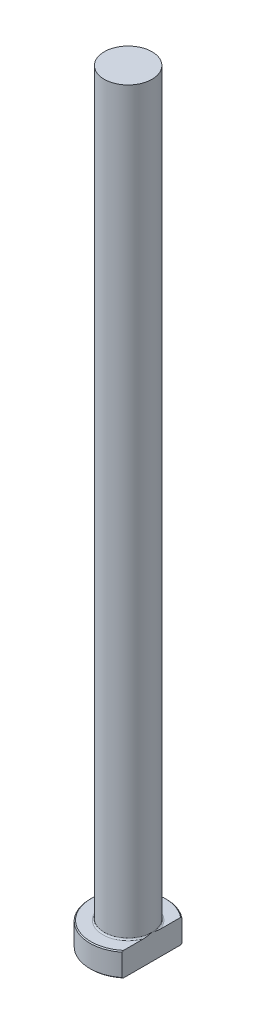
ISO-10303-21;
HEADER;
FILE_DESCRIPTION(('STEP AP214'),'2;1');
FILE_NAME('part.step','',(''),(''),'','','');
FILE_SCHEMA(('AUTOMOTIVE_DESIGN { 1 0 10303 214 1 1 1 1 }'));
ENDSEC;
DATA;
#1=APPLICATION_CONTEXT('core data for automotive mechanical design processes');
#2=APPLICATION_PROTOCOL_DEFINITION('international standard','automotive_design',2000,#1);
#3=PRODUCT_CONTEXT('',#1,'mechanical');
#4=PRODUCT('Part','Part','',(#3));
#5=PRODUCT_RELATED_PRODUCT_CATEGORY('part','',(#4));
#6=PRODUCT_DEFINITION_FORMATION('','',#4);
#7=PRODUCT_DEFINITION_CONTEXT('part definition',#1,'design');
#8=PRODUCT_DEFINITION('design','',#6,#7);
#9=PRODUCT_DEFINITION_SHAPE('','',#8);
#10=(LENGTH_UNIT() NAMED_UNIT(*) SI_UNIT(.MILLI.,.METRE.));
#11=(NAMED_UNIT(*) PLANE_ANGLE_UNIT() SI_UNIT($,.RADIAN.));
#12=(NAMED_UNIT(*) SI_UNIT($,.STERADIAN.) SOLID_ANGLE_UNIT());
#13=UNCERTAINTY_MEASURE_WITH_UNIT(LENGTH_MEASURE(1.E-05),#10,'distance_accuracy_value','');
#14=(GEOMETRIC_REPRESENTATION_CONTEXT(3) GLOBAL_UNCERTAINTY_ASSIGNED_CONTEXT((#13)) GLOBAL_UNIT_ASSIGNED_CONTEXT((#10,
#11,#12)) REPRESENTATION_CONTEXT('',''));
#15=CARTESIAN_POINT('',(0.,0.,0.));
#16=DIRECTION('',(0.,0.,1.));
#17=DIRECTION('',(1.,0.,0.));
#18=AXIS2_PLACEMENT_3D('',#15,#16,#17);
#19=CARTESIAN_POINT('',(0.,0.,0.));
#20=DIRECTION('',(0.,-1.,0.));
#21=DIRECTION('',(0.,0.,-1.));
#22=AXIS2_PLACEMENT_3D('',#19,#20,#21);
#23=PLANE('',#22);
#24=CARTESIAN_POINT('',(0.,0.,0.));
#25=DIRECTION('',(0.,-1.,0.));
#26=DIRECTION('',(0.,0.,-1.));
#27=AXIS2_PLACEMENT_3D('',#24,#25,#26);
#28=CIRCLE('',#27,7.79999999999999);
#29=CARTESIAN_POINT('',(4.99999999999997,0.,5.98665181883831));
#30=VERTEX_POINT('',#29);
#31=CARTESIAN_POINT('',(4.99999999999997,0.,-5.98665181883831));
#32=VERTEX_POINT('',#31);
#33=EDGE_CURVE('E98',#30,#32,#28,.T.);
#34=ORIENTED_EDGE('',*,*,#33,.T.);
#35=DIRECTION('',(0.,0.,1.));
#36=VECTOR('',#35,1.);
#37=CARTESIAN_POINT('',(4.99999999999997,0.,-6.24499799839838));
#38=LINE('',#37,#36);
#39=EDGE_CURVE('E83',#32,#30,#38,.T.);
#40=ORIENTED_EDGE('',*,*,#39,.T.);
#41=EDGE_LOOP('',(#34,#40));
#42=FACE_BOUND('',#41,.T.);
#43=ADVANCED_FACE('F32',(#42),#23,.T.);
#44=CARTESIAN_POINT('',(0.,259.958771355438,0.));
#45=DIRECTION('',(0.,1.,0.));
#46=DIRECTION('',(0.,0.,1.));
#47=AXIS2_PLACEMENT_3D('',#44,#45,#46);
#48=CYLINDRICAL_SURFACE('',#47,7.99999999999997);
#49=CARTESIAN_POINT('',(0.,4.79999999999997,0.));
#50=DIRECTION('',(0.,1.,0.));
#51=DIRECTION('',(0.,0.,1.));
#52=AXIS2_PLACEMENT_3D('',#49,#50,#51);
#53=CIRCLE('',#52,7.99999999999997);
#54=CARTESIAN_POINT('',(4.99999999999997,4.79999999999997,6.24499799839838));
#55=VERTEX_POINT('',#54);
#56=CARTESIAN_POINT('',(4.99999999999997,4.79999999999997,-6.24499799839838));
#57=VERTEX_POINT('',#56);
#58=EDGE_CURVE('E104',#55,#57,#53,.F.);
#59=ORIENTED_EDGE('',*,*,#58,.T.);
#60=DIRECTION('',(0.,-1.,0.));
#61=VECTOR('',#60,1.);
#62=CARTESIAN_POINT('',(4.99999999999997,160.,-6.24499799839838));
#63=LINE('',#62,#61);
#64=CARTESIAN_POINT('',(4.99999999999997,0.199999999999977,-6.24499799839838));
#65=VERTEX_POINT('',#64);
#66=EDGE_CURVE('E183',#57,#65,#63,.T.);
#67=ORIENTED_EDGE('',*,*,#66,.T.);
#68=CARTESIAN_POINT('',(0.,0.199999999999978,0.));
#69=DIRECTION('',(0.,-1.,0.));
#70=DIRECTION('',(0.,0.,-1.));
#71=AXIS2_PLACEMENT_3D('',#68,#69,#70);
#72=CIRCLE('',#71,7.99999999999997);
#73=CARTESIAN_POINT('',(4.99999999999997,0.199999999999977,6.24499799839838));
#74=VERTEX_POINT('',#73);
#75=EDGE_CURVE('E100',#65,#74,#72,.F.);
#76=ORIENTED_EDGE('',*,*,#75,.T.);
#77=DIRECTION('',(0.,-1.,0.));
#78=VECTOR('',#77,1.);
#79=CARTESIAN_POINT('',(4.99999999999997,160.,6.24499799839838));
#80=LINE('',#79,#78);
#81=EDGE_CURVE('E93',#55,#74,#80,.T.);
#82=ORIENTED_EDGE('',*,*,#81,.F.);
#83=EDGE_LOOP('',(#59,#67,#76,#82));
#84=FACE_BOUND('',#83,.T.);
#85=ADVANCED_FACE('F158',(#84),#48,.T.);
#86=CARTESIAN_POINT('',(-7.99999999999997,5.,0.));
#87=DIRECTION('',(0.,1.,0.));
#88=DIRECTION('',(0.,0.,1.));
#89=AXIS2_PLACEMENT_3D('',#86,#87,#88);
#90=PLANE('',#89);
#91=CARTESIAN_POINT('',(0.,5.,0.));
#92=DIRECTION('',(0.,1.,0.));
#93=DIRECTION('',(0.,0.,1.));
#94=AXIS2_PLACEMENT_3D('',#91,#92,#93);
#95=CIRCLE('',#94,7.79999999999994);
#96=CARTESIAN_POINT('',(4.99999999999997,5.,-5.98665181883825));
#97=VERTEX_POINT('',#96);
#98=CARTESIAN_POINT('',(4.99999999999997,5.,5.98665181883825));
#99=VERTEX_POINT('',#98);
#100=EDGE_CURVE('E178',#97,#99,#95,.T.);
#101=ORIENTED_EDGE('',*,*,#100,.T.);
#102=DIRECTION('',(0.,0.,-1.));
#103=VECTOR('',#102,1.);
#104=CARTESIAN_POINT('',(4.99999999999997,5.,0.));
#105=LINE('',#104,#103);
#106=CARTESIAN_POINT('',(4.99999999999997,4.99999999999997,1.75783958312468));
#107=VERTEX_POINT('',#106);
#108=EDGE_CURVE('E57',#99,#107,#105,.T.);
#109=ORIENTED_EDGE('',*,*,#108,.T.);
#110=CARTESIAN_POINT('',(0.,5.,0.));
#111=DIRECTION('',(0.,1.,0.));
#112=DIRECTION('',(0.,0.,1.));
#113=AXIS2_PLACEMENT_3D('',#110,#111,#112);
#114=CIRCLE('',#113,5.29999999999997);
#115=CARTESIAN_POINT('',(4.99999999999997,4.99999999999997,-1.75783958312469));
#116=VERTEX_POINT('',#115);
#117=EDGE_CURVE('E107',#107,#116,#114,.F.);
#118=ORIENTED_EDGE('',*,*,#117,.T.);
#119=EDGE_CURVE('E136',#116,#97,#105,.T.);
#120=ORIENTED_EDGE('',*,*,#119,.T.);
#121=EDGE_LOOP('',(#101,#109,#118,#120));
#122=FACE_BOUND('',#121,.T.);
#123=ADVANCED_FACE('F147',(#122),#90,.T.);
#124=CARTESIAN_POINT('',(0.,5.,0.));
#125=DIRECTION('',(0.,-1.,0.));
#126=DIRECTION('',(0.,0.,-1.));
#127=AXIS2_PLACEMENT_3D('',#124,#125,#126);
#128=CONICAL_SURFACE('',#127,7.79999999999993,0.785398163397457);
#129=ORIENTED_EDGE('',*,*,#58,.F.);
#130=CARTESIAN_POINT('',(4.99999999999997,-1.82162423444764,13.7401563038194));
#131=CARTESIAN_POINT('',(4.99999999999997,-1.61889813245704,13.5244204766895));
#132=CARTESIAN_POINT('',(4.99999999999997,-1.41646387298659,13.3084101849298));
#133=CARTESIAN_POINT('',(4.99999999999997,-1.01227657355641,12.8757508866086));
#134=CARTESIAN_POINT('',(4.99999999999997,-0.810523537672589,12.65910187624));
#135=CARTESIAN_POINT('',(4.99999999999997,-0.20615797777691,12.0077661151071));
#136=CARTESIAN_POINT('',(4.99999999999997,0.195280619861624,11.5719884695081));
#137=CARTESIAN_POINT('',(4.99999999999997,1.00388282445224,10.6856136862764));
#138=CARTESIAN_POINT('',(4.99999999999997,1.41093902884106,10.2349182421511));
#139=CARTESIAN_POINT('',(4.99999999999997,2.0165832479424,9.55471676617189));
#140=CARTESIAN_POINT('',(4.99999999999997,2.21758236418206,9.3273580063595));
#141=CARTESIAN_POINT('',(4.99999999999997,2.61761142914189,8.87091599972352));
#142=CARTESIAN_POINT('',(4.99999999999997,2.81664139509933,8.64183276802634));
#143=CARTESIAN_POINT('',(4.99999999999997,3.21217345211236,8.18170099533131));
#144=CARTESIAN_POINT('',(4.99999999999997,3.40867681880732,7.95065355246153));
#145=CARTESIAN_POINT('',(4.99999999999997,3.79865427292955,7.48599989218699));
#146=CARTESIAN_POINT('',(4.99999999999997,3.9921282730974,7.25239360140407));
#147=CARTESIAN_POINT('',(4.99999999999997,4.37558160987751,6.78155890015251));
#148=CARTESIAN_POINT('',(4.99999999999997,4.56555334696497,6.54432428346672));
#149=CARTESIAN_POINT('',(4.99999999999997,4.94042138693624,6.06589574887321));
#150=CARTESIAN_POINT('',(4.99999999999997,5.12531810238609,5.82470215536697));
#151=CARTESIAN_POINT('',(4.99999999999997,5.48653546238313,5.33972956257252));
#152=CARTESIAN_POINT('',(4.99999999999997,5.66292392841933,5.09600137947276));
#153=CARTESIAN_POINT('',(4.99999999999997,6.0067538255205,4.6021364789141));
#154=CARTESIAN_POINT('',(4.99999999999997,6.17419169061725,4.35199726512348));
#155=CARTESIAN_POINT('',(4.99999999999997,6.49592993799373,3.84445040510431));
#156=CARTESIAN_POINT('',(4.99999999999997,6.65027272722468,3.58707012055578));
#157=CARTESIAN_POINT('',(4.99999999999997,6.86813414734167,3.19356592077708));
#158=CARTESIAN_POINT('',(4.99999999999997,6.93845533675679,3.06120993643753));
#159=CARTESIAN_POINT('',(4.99999999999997,7.07360441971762,2.7937331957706));
#160=CARTESIAN_POINT('',(4.99999999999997,7.13843319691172,2.65861288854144));
#161=CARTESIAN_POINT('',(4.99999999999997,7.26869642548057,2.36936389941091));
#162=CARTESIAN_POINT('',(4.99999999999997,7.33331212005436,2.21486278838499));
#163=CARTESIAN_POINT('',(4.99999999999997,7.4524347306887,1.9019407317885));
#164=CARTESIAN_POINT('',(4.99999999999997,7.50694001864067,1.74351915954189));
#165=CARTESIAN_POINT('',(4.99999999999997,7.60343746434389,1.42384276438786));
#166=CARTESIAN_POINT('',(4.99999999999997,7.6454991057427,1.26260921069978));
#167=CARTESIAN_POINT('',(4.99999999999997,7.71543089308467,0.937062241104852));
#168=CARTESIAN_POINT('',(4.99999999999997,7.74330266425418,0.772749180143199));
#169=CARTESIAN_POINT('',(4.99999999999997,7.78344284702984,0.439876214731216));
#170=CARTESIAN_POINT('',(4.99999999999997,7.79548961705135,0.271289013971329));
#171=CARTESIAN_POINT('',(4.99999999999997,7.80240809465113,-0.0662275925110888));
#172=CARTESIAN_POINT('',(4.99999999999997,7.79728142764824,-0.235156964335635));
#173=CARTESIAN_POINT('',(4.99999999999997,7.77017954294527,-0.572209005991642));
#174=CARTESIAN_POINT('',(4.99999999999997,7.74814735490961,-0.740327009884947));
#175=CARTESIAN_POINT('',(4.99999999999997,7.68863212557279,-1.07379849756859));
#176=CARTESIAN_POINT('',(4.99999999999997,7.65114437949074,-1.23915112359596));
#177=CARTESIAN_POINT('',(4.99999999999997,7.54734433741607,-1.62344926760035));
#178=CARTESIAN_POINT('',(4.99999999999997,7.47553580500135,-1.84089917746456));
#179=CARTESIAN_POINT('',(4.99999999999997,7.3130011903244,-2.26856946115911));
#180=CARTESIAN_POINT('',(4.99999999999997,7.22226460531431,-2.47878574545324));
#181=CARTESIAN_POINT('',(4.99999999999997,7.07492970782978,-2.79014067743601));
#182=CARTESIAN_POINT('',(4.99999999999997,7.02362278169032,-2.89384077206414));
#183=CARTESIAN_POINT('',(4.99999999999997,6.91783840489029,-3.09961626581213));
#184=CARTESIAN_POINT('',(4.99999999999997,6.86336091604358,-3.20169164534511));
#185=CARTESIAN_POINT('',(4.99999999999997,6.75169048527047,-3.40428995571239));
#186=CARTESIAN_POINT('',(4.99999999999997,6.6944985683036,-3.50481345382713));
#187=CARTESIAN_POINT('',(4.99999999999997,6.57774196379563,-3.70446206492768));
#188=CARTESIAN_POINT('',(4.99999999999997,6.51817739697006,-3.80358724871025));
#189=CARTESIAN_POINT('',(4.99999999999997,6.30853654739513,-4.14435766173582));
#190=CARTESIAN_POINT('',(4.99999999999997,6.15326588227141,-4.38281352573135));
#191=CARTESIAN_POINT('',(4.99999999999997,5.8337719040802,-4.85367607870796));
#192=CARTESIAN_POINT('',(4.99999999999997,5.66954595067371,-5.08608095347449));
#193=CARTESIAN_POINT('',(4.99999999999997,5.33431698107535,-5.5462855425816));
#194=CARTESIAN_POINT('',(4.99999999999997,5.16330740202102,-5.77408045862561));
#195=CARTESIAN_POINT('',(4.99999999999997,4.81629923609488,-6.22578157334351));
#196=CARTESIAN_POINT('',(4.99999999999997,4.64030119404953,-6.4496881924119));
#197=CARTESIAN_POINT('',(4.99999999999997,4.28368615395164,-6.89532578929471));
#198=CARTESIAN_POINT('',(4.99999999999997,4.10305289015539,-7.11704371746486));
#199=CARTESIAN_POINT('',(4.99999999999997,3.73870710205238,-7.55793799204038));
#200=CARTESIAN_POINT('',(4.99999999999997,3.55499450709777,-7.77711427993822));
#201=CARTESIAN_POINT('',(4.99999999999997,3.1852108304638,-8.21325328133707));
#202=CARTESIAN_POINT('',(4.99999999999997,2.99914113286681,-8.43021717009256));
#203=CARTESIAN_POINT('',(4.99999999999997,2.62499812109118,-8.86241167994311));
#204=CARTESIAN_POINT('',(4.99999999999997,2.43692478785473,-9.07764228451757));
#205=CARTESIAN_POINT('',(4.99999999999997,1.9146340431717,-9.67075518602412));
#206=CARTESIAN_POINT('',(4.99999999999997,1.57868086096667,-10.0471086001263));
#207=CARTESIAN_POINT('',(4.99999999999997,0.903003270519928,-10.7965122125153));
#208=CARTESIAN_POINT('',(4.99999999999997,0.56327827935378,-11.1695618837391));
#209=CARTESIAN_POINT('',(4.99999999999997,-0.116149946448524,-11.9100168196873));
#210=CARTESIAN_POINT('',(4.99999999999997,-0.455830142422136,-12.2774432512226));
#211=CARTESIAN_POINT('',(4.99999999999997,-1.13728640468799,-13.0102135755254));
#212=CARTESIAN_POINT('',(4.99999999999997,-1.479062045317,-13.3755578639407));
#213=CARTESIAN_POINT('',(4.99999999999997,-1.82162423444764,-13.7401563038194));
#214=B_SPLINE_CURVE_WITH_KNOTS('',3,(#130,#131,#132,#133,#134,#135,#136,#137,#138,#139,#140,
#141,#142,#143,#144,#145,#146,#147,#148,#149,#150,#151,#152,#153,#154,#155,#156,#157,#158,#159,
#160,#161,#162,#163,#164,#165,#166,#167,#168,#169,#170,#171,#172,#173,#174,#175,#176,#177,#178,
#179,#180,#181,#182,#183,#184,#185,#186,#187,#188,#189,#190,#191,#192,#193,#194,#195,#196,#197,
#198,#199,#200,#201,#202,#203,#204,#205,#206,#207,#208,#209,#210,#211,#212,#213),.UNSPECIFIED.,
.F.,.F.,(4,2,2,2,2,2,2,2,2,2,2,2,2,2,2,2,2,2,2,2,2,2,2,2,2,2,2,2,2,2,2,2,2,2,2,2,2,2,2,2,2,4),
(0.,0.888120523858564,1.77624635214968,3.5537251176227,5.3755948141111,6.28598924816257,
7.19637570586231,8.10628289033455,9.01621623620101,9.92793449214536,10.8395784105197,
11.7420025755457,12.6447836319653,13.5445196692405,13.9940505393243,14.4435089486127,
14.9456212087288,15.4478142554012,15.947147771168,16.4464240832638,16.952621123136,
17.4587702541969,17.966632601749,18.4746496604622,19.160451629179,19.8466351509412,
20.1936870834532,20.5407431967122,20.8876692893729,21.2345777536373,22.0879097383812,
22.9414946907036,23.7959266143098,24.6502655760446,25.5081848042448,26.3661237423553,
27.2235803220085,28.0810450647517,29.5944656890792,31.1081235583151,32.6092678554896,
34.1101167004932),.UNSPECIFIED.);
#215=EDGE_CURVE('E135',#55,#99,#214,.T.);
#216=ORIENTED_EDGE('',*,*,#215,.T.);
#217=ORIENTED_EDGE('',*,*,#100,.F.);
#218=EDGE_CURVE('E127',#97,#57,#214,.T.);
#219=ORIENTED_EDGE('',*,*,#218,.T.);
#220=EDGE_LOOP('',(#129,#216,#217,#219));
#221=FACE_BOUND('',#220,.T.);
#222=ADVANCED_FACE('F143',(#221),#128,.T.);
#223=CARTESIAN_POINT('',(0.,0.199999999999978,0.));
#224=DIRECTION('',(0.,1.,0.));
#225=DIRECTION('',(0.,0.,1.));
#226=AXIS2_PLACEMENT_3D('',#223,#224,#225);
#227=CONICAL_SURFACE('',#226,7.99999999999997,0.785398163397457);
#228=ORIENTED_EDGE('',*,*,#75,.F.);
#229=CARTESIAN_POINT('',(4.99999999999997,6.82162423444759,-13.7401563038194));
#230=CARTESIAN_POINT('',(4.99999999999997,6.61889813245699,-13.5244204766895));
#231=CARTESIAN_POINT('',(4.99999999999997,6.41646387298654,-13.3084101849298));
#232=CARTESIAN_POINT('',(4.99999999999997,6.01227657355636,-12.8757508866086));
#233=CARTESIAN_POINT('',(4.99999999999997,5.81052353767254,-12.65910187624));
#234=CARTESIAN_POINT('',(4.99999999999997,5.20615797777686,-12.0077661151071));
#235=CARTESIAN_POINT('',(4.99999999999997,4.80471938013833,-11.5719884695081));
#236=CARTESIAN_POINT('',(4.99999999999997,3.99611717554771,-10.6856136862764));
#237=CARTESIAN_POINT('',(4.99999999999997,3.5890609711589,-10.2349182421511));
#238=CARTESIAN_POINT('',(4.99999999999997,2.98341675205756,-9.5547167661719));
#239=CARTESIAN_POINT('',(4.99999999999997,2.78241763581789,-9.3273580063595));
#240=CARTESIAN_POINT('',(4.99999999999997,2.38238857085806,-8.87091599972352));
#241=CARTESIAN_POINT('',(4.99999999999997,2.18335860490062,-8.64183276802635));
#242=CARTESIAN_POINT('',(4.99999999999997,1.78782654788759,-8.18170099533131));
#243=CARTESIAN_POINT('',(4.99999999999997,1.59132318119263,-7.95065355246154));
#244=CARTESIAN_POINT('',(4.99999999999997,1.2013457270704,-7.485999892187));
#245=CARTESIAN_POINT('',(4.99999999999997,1.00787172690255,-7.25239360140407));
#246=CARTESIAN_POINT('',(4.99999999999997,0.624418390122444,-6.78155890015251));
#247=CARTESIAN_POINT('',(4.99999999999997,0.434446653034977,-6.54432428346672));
#248=CARTESIAN_POINT('',(4.99999999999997,0.0595786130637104,-6.06589574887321));
#249=CARTESIAN_POINT('',(4.99999999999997,-0.125318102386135,-5.82470215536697));
#250=CARTESIAN_POINT('',(4.99999999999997,-0.486535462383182,-5.33972956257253));
#251=CARTESIAN_POINT('',(4.99999999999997,-0.662923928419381,-5.09600137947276));
#252=CARTESIAN_POINT('',(4.99999999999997,-1.00675382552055,-4.6021364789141));
#253=CARTESIAN_POINT('',(4.99999999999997,-1.1741916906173,-4.35199726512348));
#254=CARTESIAN_POINT('',(4.99999999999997,-1.49592993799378,-3.84445040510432));
#255=CARTESIAN_POINT('',(4.99999999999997,-1.65027272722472,-3.58707012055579));
#256=CARTESIAN_POINT('',(4.99999999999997,-1.86813414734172,-3.19356592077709));
#257=CARTESIAN_POINT('',(4.99999999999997,-1.93845533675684,-3.06120993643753));
#258=CARTESIAN_POINT('',(4.99999999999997,-2.07360441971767,-2.79373319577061));
#259=CARTESIAN_POINT('',(4.99999999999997,-2.13843319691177,-2.65861288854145));
#260=CARTESIAN_POINT('',(4.99999999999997,-2.26869642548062,-2.36936389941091));
#261=CARTESIAN_POINT('',(4.99999999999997,-2.33331212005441,-2.214862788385));
#262=CARTESIAN_POINT('',(4.99999999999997,-2.45243473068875,-1.90194073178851));
#263=CARTESIAN_POINT('',(4.99999999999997,-2.50694001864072,-1.74351915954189));
#264=CARTESIAN_POINT('',(4.99999999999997,-2.60343746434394,-1.42384276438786));
#265=CARTESIAN_POINT('',(4.99999999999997,-2.64549910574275,-1.26260921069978));
#266=CARTESIAN_POINT('',(4.99999999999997,-2.71543089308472,-0.937062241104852));
#267=CARTESIAN_POINT('',(4.99999999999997,-2.74330266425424,-0.7727491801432));
#268=CARTESIAN_POINT('',(4.99999999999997,-2.78344284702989,-0.439876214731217));
#269=CARTESIAN_POINT('',(4.99999999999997,-2.7954896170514,-0.271289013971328));
#270=CARTESIAN_POINT('',(4.99999999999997,-2.80240809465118,0.0662275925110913));
#271=CARTESIAN_POINT('',(4.99999999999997,-2.79728142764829,0.235156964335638));
#272=CARTESIAN_POINT('',(4.99999999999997,-2.77017954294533,0.572209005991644));
#273=CARTESIAN_POINT('',(4.99999999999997,-2.74814735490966,0.740327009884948));
#274=CARTESIAN_POINT('',(4.99999999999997,-2.68863212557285,1.07379849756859));
#275=CARTESIAN_POINT('',(4.99999999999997,-2.65114437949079,1.23915112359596));
#276=CARTESIAN_POINT('',(4.99999999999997,-2.54734433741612,1.62344926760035));
#277=CARTESIAN_POINT('',(4.99999999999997,-2.4755358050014,1.84089917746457));
#278=CARTESIAN_POINT('',(4.99999999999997,-2.31300119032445,2.26856946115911));
#279=CARTESIAN_POINT('',(4.99999999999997,-2.22226460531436,2.47878574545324));
#280=CARTESIAN_POINT('',(4.99999999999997,-2.07492970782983,2.79014067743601));
#281=CARTESIAN_POINT('',(4.99999999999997,-2.02362278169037,2.89384077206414));
#282=CARTESIAN_POINT('',(4.99999999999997,-1.91783840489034,3.09961626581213));
#283=CARTESIAN_POINT('',(4.99999999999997,-1.86336091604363,3.20169164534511));
#284=CARTESIAN_POINT('',(4.99999999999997,-1.75169048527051,3.4042899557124));
#285=CARTESIAN_POINT('',(4.99999999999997,-1.69449856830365,3.50481345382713));
#286=CARTESIAN_POINT('',(4.99999999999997,-1.57774196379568,3.70446206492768));
#287=CARTESIAN_POINT('',(4.99999999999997,-1.51817739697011,3.80358724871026));
#288=CARTESIAN_POINT('',(4.99999999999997,-1.30853654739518,4.14435766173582));
#289=CARTESIAN_POINT('',(4.99999999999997,-1.15326588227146,4.38281352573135));
#290=CARTESIAN_POINT('',(4.99999999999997,-0.833771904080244,4.85367607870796));
#291=CARTESIAN_POINT('',(4.99999999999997,-0.669545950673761,5.08608095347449));
#292=CARTESIAN_POINT('',(4.99999999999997,-0.334316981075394,5.5462855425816));
#293=CARTESIAN_POINT('',(4.99999999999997,-0.163307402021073,5.77408045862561));
#294=CARTESIAN_POINT('',(4.99999999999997,0.18370076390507,6.22578157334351));
#295=CARTESIAN_POINT('',(4.99999999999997,0.359698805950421,6.4496881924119));
#296=CARTESIAN_POINT('',(4.99999999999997,0.716313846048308,6.89532578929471));
#297=CARTESIAN_POINT('',(4.99999999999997,0.896947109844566,7.11704371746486));
#298=CARTESIAN_POINT('',(4.99999999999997,1.26129289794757,7.55793799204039));
#299=CARTESIAN_POINT('',(4.99999999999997,1.44500549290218,7.77711427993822));
#300=CARTESIAN_POINT('',(4.99999999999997,1.81478916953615,8.21325328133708));
#301=CARTESIAN_POINT('',(4.99999999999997,2.00085886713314,8.43021717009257));
#302=CARTESIAN_POINT('',(4.99999999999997,2.37500187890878,8.86241167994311));
#303=CARTESIAN_POINT('',(4.99999999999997,2.56307521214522,9.07764228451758));
#304=CARTESIAN_POINT('',(4.99999999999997,3.08536595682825,9.67075518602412));
#305=CARTESIAN_POINT('',(4.99999999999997,3.42131913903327,10.0471086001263));
#306=CARTESIAN_POINT('',(4.99999999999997,4.09699672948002,10.7965122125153));
#307=CARTESIAN_POINT('',(4.99999999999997,4.43672172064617,11.1695618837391));
#308=CARTESIAN_POINT('',(4.99999999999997,5.11614994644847,11.9100168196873));
#309=CARTESIAN_POINT('',(4.99999999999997,5.45583014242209,12.2774432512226));
#310=CARTESIAN_POINT('',(4.99999999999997,6.13728640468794,13.0102135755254));
#311=CARTESIAN_POINT('',(4.99999999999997,6.47906204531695,13.3755578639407));
#312=CARTESIAN_POINT('',(4.99999999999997,6.82162423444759,13.7401563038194));
#313=B_SPLINE_CURVE_WITH_KNOTS('',3,(#229,#230,#231,#232,#233,#234,#235,#236,#237,#238,#239,
#240,#241,#242,#243,#244,#245,#246,#247,#248,#249,#250,#251,#252,#253,#254,#255,#256,#257,#258,
#259,#260,#261,#262,#263,#264,#265,#266,#267,#268,#269,#270,#271,#272,#273,#274,#275,#276,#277,
#278,#279,#280,#281,#282,#283,#284,#285,#286,#287,#288,#289,#290,#291,#292,#293,#294,#295,#296,
#297,#298,#299,#300,#301,#302,#303,#304,#305,#306,#307,#308,#309,#310,#311,#312),.UNSPECIFIED.,
.F.,.F.,(4,2,2,2,2,2,2,2,2,2,2,2,2,2,2,2,2,2,2,2,2,2,2,2,2,2,2,2,2,2,2,2,2,2,2,2,2,2,2,2,2,4),
(0.,0.888120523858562,1.77624635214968,3.5537251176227,5.3755948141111,6.28598924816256,
7.19637570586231,8.10628289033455,9.01621623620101,9.92793449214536,10.8395784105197,
11.7420025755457,12.6447836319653,13.5445196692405,13.9940505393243,14.4435089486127,
14.9456212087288,15.4478142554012,15.9471477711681,16.4464240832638,16.952621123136,
17.458770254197,17.966632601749,18.4746496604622,19.160451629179,19.8466351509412,
20.1936870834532,20.5407431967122,20.8876692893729,21.2345777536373,22.0879097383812,
22.9414946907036,23.7959266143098,24.6502655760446,25.5081848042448,26.3661237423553,
27.2235803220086,28.0810450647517,29.5944656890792,31.1081235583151,32.6092678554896,
34.1101167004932),.UNSPECIFIED.);
#314=EDGE_CURVE('E86',#65,#32,#313,.T.);
#315=ORIENTED_EDGE('',*,*,#314,.T.);
#316=ORIENTED_EDGE('',*,*,#33,.F.);
#317=EDGE_CURVE('E89',#30,#74,#313,.T.);
#318=ORIENTED_EDGE('',*,*,#317,.T.);
#319=EDGE_LOOP('',(#228,#315,#316,#318));
#320=FACE_BOUND('',#319,.T.);
#321=ADVANCED_FACE('F97',(#320),#227,.T.);
#322=CARTESIAN_POINT('',(0.,5.29999999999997,0.));
#323=DIRECTION('',(0.,1.,0.));
#324=DIRECTION('',(0.,0.,1.));
#325=AXIS2_PLACEMENT_3D('',#322,#323,#324);
#326=TOROIDAL_SURFACE('',#325,5.29999999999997,0.3);
#327=CARTESIAN_POINT('',(4.99999999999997,5.29999999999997,0.));
#328=CARTESIAN_POINT('',(4.99999999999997,5.30000062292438,1.31470000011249E-10));
#329=CARTESIAN_POINT('',(4.99999999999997,5.30000124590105,-2.52759208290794E-07));
#330=CARTESIAN_POINT('',(4.99999999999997,5.30000240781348,-9.4716432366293E-07));
#331=CARTESIAN_POINT('',(4.99999999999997,5.30000293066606,-1.40594035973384E-06));
#332=CARTESIAN_POINT('',(4.99999999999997,5.30000402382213,-2.50637603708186E-06));
#333=CARTESIAN_POINT('',(4.99999999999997,5.30000457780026,-3.16588904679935E-06));
#334=CARTESIAN_POINT('',(4.99999999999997,5.30000556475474,-4.52859961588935E-06));
#335=CARTESIAN_POINT('',(4.99999999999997,5.30000600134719,-5.22939444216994E-06));
#336=CARTESIAN_POINT('',(4.99999999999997,5.30000763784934,-7.96121978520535E-06));
#337=CARTESIAN_POINT('',(4.99999999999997,5.30000875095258,-1.0047740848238E-05));
#338=CARTESIAN_POINT('',(4.99999999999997,5.30001056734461,-1.41660873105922E-05));
#339=CARTESIAN_POINT('',(4.99999999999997,5.30001129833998,-1.61861783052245E-05));
#340=CARTESIAN_POINT('',(4.99999999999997,5.30001439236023,-2.47865739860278E-05));
#341=CARTESIAN_POINT('',(4.99999999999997,5.30001672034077,-3.1383028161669E-05));
#342=CARTESIAN_POINT('',(4.99999999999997,5.30002012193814,-4.38084218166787E-05));
#343=CARTESIAN_POINT('',(4.99999999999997,5.30002133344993,-4.95992736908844E-05));
#344=CARTESIAN_POINT('',(4.99999999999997,5.30003020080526,-9.27862610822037E-05));
#345=CARTESIAN_POINT('',(4.99999999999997,5.30003696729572,-0.000130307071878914));
#346=CARTESIAN_POINT('',(4.99999999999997,5.30006659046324,-0.000278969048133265));
#347=CARTESIAN_POINT('',(4.99999999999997,5.30009481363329,-0.000389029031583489));
#348=CARTESIAN_POINT('',(4.99999999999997,5.3002050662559,-0.000826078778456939));
#349=CARTESIAN_POINT('',(4.99999999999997,5.30028365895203,-0.0011536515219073));
#350=CARTESIAN_POINT('',(4.99999999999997,5.300599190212,-0.0024592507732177));
#351=CARTESIAN_POINT('',(4.99999999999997,5.30084048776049,-0.00343651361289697));
#352=CARTESIAN_POINT('',(4.99999999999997,5.3018462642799,-0.00752058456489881));
#353=CARTESIAN_POINT('',(4.99999999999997,5.3026052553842,-0.0106283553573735));
#354=CARTESIAN_POINT('',(4.99999999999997,5.30996461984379,-0.0407482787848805));
#355=CARTESIAN_POINT('',(4.99999999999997,5.31658985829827,-0.0677561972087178));
#356=CARTESIAN_POINT('',(4.99999999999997,5.32953319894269,-0.120688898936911));
#357=CARTESIAN_POINT('',(4.99999999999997,5.33585289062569,-0.146613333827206));
#358=CARTESIAN_POINT('',(4.99999999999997,5.34926050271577,-0.201795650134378));
#359=CARTESIAN_POINT('',(4.99999999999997,5.35634306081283,-0.231054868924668));
#360=CARTESIAN_POINT('',(4.99999999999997,5.37050252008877,-0.289917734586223));
#361=CARTESIAN_POINT('',(4.99999999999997,5.37757848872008,-0.319521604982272));
#362=CARTESIAN_POINT('',(4.99999999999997,5.39452602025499,-0.391032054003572));
#363=CARTESIAN_POINT('',(4.99999999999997,5.40434071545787,-0.432952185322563));
#364=CARTESIAN_POINT('',(4.99999999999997,5.42340141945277,-0.51576321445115));
#365=CARTESIAN_POINT('',(4.99999999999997,5.43265559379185,-0.556652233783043));
#366=CARTESIAN_POINT('',(4.99999999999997,5.45710553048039,-0.667075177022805));
#367=CARTESIAN_POINT('',(4.99999999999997,5.47194176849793,-0.736689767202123));
#368=CARTESIAN_POINT('',(4.99999999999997,5.50018229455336,-0.876836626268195));
#369=CARTESIAN_POINT('',(4.99999999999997,5.51357312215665,-0.947371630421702));
#370=CARTESIAN_POINT('',(4.99999999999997,5.53930921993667,-1.09497328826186));
#371=CARTESIAN_POINT('',(4.99999999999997,5.55146217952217,-1.17207432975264));
#372=CARTESIAN_POINT('',(4.99999999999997,5.57239669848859,-1.32672649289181));
#373=CARTESIAN_POINT('',(4.99999999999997,5.58117877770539,-1.40427754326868));
#374=CARTESIAN_POINT('',(4.99999999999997,5.594997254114,-1.5687382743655));
#375=CARTESIAN_POINT('',(4.99999999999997,5.59948802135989,-1.65570044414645));
#376=CARTESIAN_POINT('',(4.99999999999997,5.60018885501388,-1.78535304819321));
#377=CARTESIAN_POINT('',(4.99999999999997,5.59945214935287,-1.82802575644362));
#378=CARTESIAN_POINT('',(4.99999999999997,5.59559364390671,-1.91325081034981));
#379=CARTESIAN_POINT('',(4.99999999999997,5.59247319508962,-1.95580321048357));
#380=CARTESIAN_POINT('',(4.99999999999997,5.5838324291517,-2.03512365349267));
#381=CARTESIAN_POINT('',(4.99999999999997,5.57867386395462,-2.07192937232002));
#382=CARTESIAN_POINT('',(4.99999999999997,5.56543793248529,-2.1452675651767));
#383=CARTESIAN_POINT('',(4.99999999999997,5.55734203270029,-2.18179676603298));
#384=CARTESIAN_POINT('',(4.99999999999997,5.53718005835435,-2.25427226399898));
#385=CARTESIAN_POINT('',(4.99999999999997,5.52507057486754,-2.29020746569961));
#386=CARTESIAN_POINT('',(4.99999999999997,5.50270928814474,-2.34223029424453));
#387=CARTESIAN_POINT('',(4.99999999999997,5.4945781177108,-2.35922314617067));
#388=CARTESIAN_POINT('',(4.99999999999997,5.47657809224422,-2.39224900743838));
#389=CARTESIAN_POINT('',(4.99999999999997,5.46671281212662,-2.40828390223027));
#390=CARTESIAN_POINT('',(4.99999999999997,5.44695893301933,-2.43579467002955));
#391=CARTESIAN_POINT('',(4.99999999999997,5.4374587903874,-2.44754592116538));
#392=CARTESIAN_POINT('',(4.99999999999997,5.41677914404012,-2.46946476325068));
#393=CARTESIAN_POINT('',(4.99999999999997,5.40560543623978,-2.47963758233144));
#394=CARTESIAN_POINT('',(4.99999999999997,5.38617750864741,-2.49393642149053));
#395=CARTESIAN_POINT('',(4.99999999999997,5.37851643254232,-2.49886271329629));
#396=CARTESIAN_POINT('',(4.99999999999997,5.36252740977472,-2.50749953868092));
#397=CARTESIAN_POINT('',(4.99999999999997,5.35419984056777,-2.51121075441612));
#398=CARTESIAN_POINT('',(4.99999999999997,5.33690648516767,-2.51712941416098));
#399=CARTESIAN_POINT('',(4.99999999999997,5.3279345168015,-2.51931927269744));
#400=CARTESIAN_POINT('',(4.99999999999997,5.30973576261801,-2.52185978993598));
#401=CARTESIAN_POINT('',(4.99999999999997,5.30050931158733,-2.52221275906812));
#402=CARTESIAN_POINT('',(4.99999999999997,5.28349166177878,-2.52112455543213));
#403=CARTESIAN_POINT('',(4.99999999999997,5.27568322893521,-2.519931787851));
#404=CARTESIAN_POINT('',(4.99999999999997,5.26036860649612,-2.51628294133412));
#405=CARTESIAN_POINT('',(4.99999999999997,5.25286261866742,-2.51382603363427));
#406=CARTESIAN_POINT('',(4.99999999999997,5.23590266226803,-2.50685484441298));
#407=CARTESIAN_POINT('',(4.99999999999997,5.22661875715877,-2.50192984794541));
#408=CARTESIAN_POINT('',(4.99999999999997,5.20895514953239,-2.49066548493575));
#409=CARTESIAN_POINT('',(4.99999999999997,5.20057756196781,-2.48432291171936));
#410=CARTESIAN_POINT('',(4.99999999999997,5.1798700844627,-2.46645212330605));
#411=CARTESIAN_POINT('',(4.99999999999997,5.1682415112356,-2.45411867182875));
#412=CARTESIAN_POINT('',(4.99999999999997,5.14692461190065,-2.42790849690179));
#413=CARTESIAN_POINT('',(4.99999999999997,5.13723987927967,-2.41402898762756));
#414=CARTESIAN_POINT('',(4.99999999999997,5.11080706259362,-2.37143175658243));
#415=CARTESIAN_POINT('',(4.99999999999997,5.09628770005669,-2.34134703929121));
#416=CARTESIAN_POINT('',(4.99999999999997,5.07130349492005,-2.27940731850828));
#417=CARTESIAN_POINT('',(4.99999999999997,5.06087110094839,-2.24754035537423));
#418=CARTESIAN_POINT('',(4.99999999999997,5.03890359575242,-2.16787245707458));
#419=CARTESIAN_POINT('',(4.99999999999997,5.02913523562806,-2.1195906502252));
#420=CARTESIAN_POINT('',(4.99999999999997,5.01416953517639,-2.02224928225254));
#421=CARTESIAN_POINT('',(4.99999999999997,5.00898637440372,-1.97318778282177));
#422=CARTESIAN_POINT('',(4.99999999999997,5.00220823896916,-1.87635767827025));
#423=CARTESIAN_POINT('',(4.99999999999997,5.00050709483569,-1.82859609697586));
#424=CARTESIAN_POINT('',(4.99999999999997,4.99969104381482,-1.73330165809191));
#425=CARTESIAN_POINT('',(4.99999999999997,5.00056327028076,-1.68576884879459));
#426=CARTESIAN_POINT('',(4.99999999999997,5.0048429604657,-1.57937770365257));
#427=CARTESIAN_POINT('',(4.99999999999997,5.00880932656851,-1.52054285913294));
#428=CARTESIAN_POINT('',(4.99999999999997,5.01925964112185,-1.40312974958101));
#429=CARTESIAN_POINT('',(4.99999999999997,5.02574264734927,-1.34455139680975));
#430=CARTESIAN_POINT('',(4.99999999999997,5.04090087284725,-1.22627662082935));
#431=CARTESIAN_POINT('',(4.99999999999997,5.0496242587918,-1.16658647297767));
#432=CARTESIAN_POINT('',(4.99999999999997,5.06877923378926,-1.04732463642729));
#433=CARTESIAN_POINT('',(4.99999999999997,5.07921523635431,-0.987753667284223));
#434=CARTESIAN_POINT('',(4.99999999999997,5.10551698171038,-0.846936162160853));
#435=CARTESIAN_POINT('',(4.99999999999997,5.12196565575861,-0.765799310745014));
#436=CARTESIAN_POINT('',(4.99999999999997,5.15639716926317,-0.604819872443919));
#437=CARTESIAN_POINT('',(4.99999999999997,5.17436050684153,-0.524973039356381));
#438=CARTESIAN_POINT('',(4.99999999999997,5.20921667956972,-0.374726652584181));
#439=CARTESIAN_POINT('',(4.99999999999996,5.22599388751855,-0.304300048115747));
#440=CARTESIAN_POINT('',(4.99999999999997,5.2519110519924,-0.196907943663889));
#441=CARTESIAN_POINT('',(4.99999999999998,5.26090146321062,-0.159905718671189));
#442=CARTESIAN_POINT('',(4.99999999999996,5.27881854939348,-0.0865164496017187));
#443=CARTESIAN_POINT('',(4.99999999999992,5.28774391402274,-0.0501291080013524));
#444=CARTESIAN_POINT('',(4.99999999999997,5.29739627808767,-0.0106218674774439));
#445=CARTESIAN_POINT('',(4.99999999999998,5.2981568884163,-0.00750762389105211));
#446=CARTESIAN_POINT('',(4.99999999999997,5.2991630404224,-0.00342209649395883));
#447=CARTESIAN_POINT('',(4.99999999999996,5.29940309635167,-0.00244985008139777));
#448=CARTESIAN_POINT('',(4.99999999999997,5.29971711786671,-0.00115049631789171));
#449=CARTESIAN_POINT('',(4.99999999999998,5.299795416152,-0.000824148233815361));
#450=CARTESIAN_POINT('',(4.99999999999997,5.2999053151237,-0.000388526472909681));
#451=CARTESIAN_POINT('',(4.99999999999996,5.29993348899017,-0.0002786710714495));
#452=CARTESIAN_POINT('',(4.99999999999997,5.29996306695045,-0.000130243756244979));
#453=CARTESIAN_POINT('',(4.99999999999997,5.29996982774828,-9.2751137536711E-05));
#454=CARTESIAN_POINT('',(4.99999999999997,5.29997868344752,-4.95929887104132E-05));
#455=CARTESIAN_POINT('',(4.99999999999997,5.29997989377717,-4.38036553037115E-05));
#456=CARTESIAN_POINT('',(4.99999999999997,5.29998329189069,-3.13814183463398E-05));
#457=CARTESIAN_POINT('',(4.99999999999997,5.29998561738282,-2.4786521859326E-05));
#458=CARTESIAN_POINT('',(4.99999999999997,5.29998870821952,-1.61877546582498E-05));
#459=CARTESIAN_POINT('',(4.99999999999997,5.29998943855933,-1.41677768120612E-05));
#460=CARTESIAN_POINT('',(4.99999999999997,5.29999125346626,-1.00495530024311E-05));
#461=CARTESIAN_POINT('',(4.99999999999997,5.29999236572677,-7.96302653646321E-06));
#462=CARTESIAN_POINT('',(4.99999999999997,5.29999400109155,-5.23107415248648E-06));
#463=CARTESIAN_POINT('',(4.99999999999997,5.29999443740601,-4.53021031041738E-06));
#464=CARTESIAN_POINT('',(4.99999999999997,5.29999542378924,-3.16731152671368E-06));
#465=CARTESIAN_POINT('',(4.99999999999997,5.29999597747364,-2.50767725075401E-06));
#466=CARTESIAN_POINT('',(4.99999999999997,5.29999707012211,-1.40695877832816E-06));
#467=CARTESIAN_POINT('',(4.99999999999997,5.29999759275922,-9.48032431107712E-07));
#468=CARTESIAN_POINT('',(4.99999999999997,5.29999875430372,-2.53244317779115E-07));
#469=CARTESIAN_POINT('',(4.99999999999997,5.29999937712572,-1.3145941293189E-10));
#470=CARTESIAN_POINT('',(4.99999999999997,5.29999999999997,0.));
#471=B_SPLINE_CURVE_WITH_KNOTS('',3,(#327,#328,#329,#330,#331,#332,#333,#334,#335,#336,#337,
#338,#339,#340,#341,#342,#343,#344,#345,#346,#347,#348,#349,#350,#351,#352,#353,#354,#355,#356,
#357,#358,#359,#360,#361,#362,#363,#364,#365,#366,#367,#368,#369,#370,#371,#372,#373,#374,#375,
#376,#377,#378,#379,#380,#381,#382,#383,#384,#385,#386,#387,#388,#389,#390,#391,#392,#393,#394,
#395,#396,#397,#398,#399,#400,#401,#402,#403,#404,#405,#406,#407,#408,#409,#410,#411,#412,#413,
#414,#415,#416,#417,#418,#419,#420,#421,#422,#423,#424,#425,#426,#427,#428,#429,#430,#431,#432,
#433,#434,#435,#436,#437,#438,#439,#440,#441,#442,#443,#444,#445,#446,#447,#448,#449,#450,#451,
#452,#453,#454,#455,#456,#457,#458,#459,#460,#461,#462,#463,#464,#465,#466,#467,#468,#469,#470),
.UNSPECIFIED.,.T.,.F.,(4,2,2,2,2,2,2,2,2,2,2,2,2,2,2,2,2,2,2,2,2,2,2,2,2,2,2,2,2,2,2,2,2,2,2,2,
2,2,2,2,2,2,2,2,2,2,2,2,2,2,2,2,2,2,2,2,2,2,2,2,2,2,2,2,2,2,2,2,2,2,2,4),(0.,
1.88939317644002E-06,3.98058917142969E-06,6.54818564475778E-06,9.0240439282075E-06,
1.60938750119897E-05,2.25328198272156E-05,4.34843921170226E-05,6.12120199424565E-05,
0.000175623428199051,0.000516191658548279,0.00152710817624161,0.00454656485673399,
0.0141443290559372,0.0975679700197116,0.177619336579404,0.267931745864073,0.35924502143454,
0.488405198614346,0.614173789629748,0.827694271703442,1.04305715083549,1.27715608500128,
1.51121890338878,1.77214751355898,1.9001350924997,2.02805018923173,2.13945459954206,
2.25157451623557,2.36494894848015,2.4213923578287,2.47772074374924,2.52293802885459,
2.56800219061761,2.59524342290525,2.62246933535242,2.65000494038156,2.67750590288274,
2.70108948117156,2.72468854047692,2.75603978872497,2.78746268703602,2.83802806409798,
2.888686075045,2.98834295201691,3.0887757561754,3.23618650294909,3.38405153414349,
3.52733651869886,3.66990630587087,3.84673903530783,4.02350562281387,4.20444776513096,
4.38586374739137,4.63419556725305,4.87971270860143,5.09690175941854,5.21113882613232,
5.32353360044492,5.33315137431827,5.33615533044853,5.33716246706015,5.33750240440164,
5.33761672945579,5.33763445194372,5.33765539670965,5.33766183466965,5.33766890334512,
5.33767137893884,5.3376739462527,5.33767603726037,5.3376779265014),.UNSPECIFIED.);
#472=CARTESIAN_POINT('',(4.99999999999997,5.29999999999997,0.));
#473=VERTEX_POINT('',#472);
#474=EDGE_CURVE('E11',#116,#473,#471,.T.);
#475=ORIENTED_EDGE('',*,*,#474,.F.);
#476=ORIENTED_EDGE('',*,*,#117,.F.);
#477=CARTESIAN_POINT('',(4.99999999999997,5.29999999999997,0.));
#478=CARTESIAN_POINT('',(4.99999999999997,5.29999937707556,-1.31470067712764E-10));
#479=CARTESIAN_POINT('',(4.99999999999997,5.29999875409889,2.5275920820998E-07));
#480=CARTESIAN_POINT('',(4.99999999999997,5.29999759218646,9.4716432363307E-07));
#481=CARTESIAN_POINT('',(4.99999999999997,5.29999706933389,1.40594035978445E-06));
#482=CARTESIAN_POINT('',(4.99999999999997,5.29999597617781,2.5063760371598E-06));
#483=CARTESIAN_POINT('',(4.99999999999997,5.29999542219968,3.16588904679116E-06));
#484=CARTESIAN_POINT('',(4.99999999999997,5.2999944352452,4.52859961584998E-06));
#485=CARTESIAN_POINT('',(4.99999999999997,5.29999399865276,5.22939444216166E-06));
#486=CARTESIAN_POINT('',(4.99999999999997,5.2999923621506,7.96121978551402E-06));
#487=CARTESIAN_POINT('',(4.99999999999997,5.29999124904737,1.00477408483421E-05));
#488=CARTESIAN_POINT('',(4.99999999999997,5.29998943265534,1.41660873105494E-05));
#489=CARTESIAN_POINT('',(4.99999999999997,5.29998870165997,1.61861783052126E-05));
#490=CARTESIAN_POINT('',(4.99999999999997,5.29998560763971,2.47865739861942E-05));
#491=CARTESIAN_POINT('',(4.99999999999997,5.29998327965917,3.13830281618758E-05));
#492=CARTESIAN_POINT('',(4.99999999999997,5.2999798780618,4.38084218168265E-05));
#493=CARTESIAN_POINT('',(4.99999999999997,5.29997866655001,4.95992736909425E-05));
#494=CARTESIAN_POINT('',(4.99999999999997,5.29996979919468,9.27862610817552E-05));
#495=CARTESIAN_POINT('',(4.99999999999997,5.29996303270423,0.000130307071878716));
#496=CARTESIAN_POINT('',(4.99999999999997,5.2999334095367,0.000278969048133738));
#497=CARTESIAN_POINT('',(4.99999999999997,5.29990518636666,0.000389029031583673));
#498=CARTESIAN_POINT('',(4.99999999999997,5.29979493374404,0.000826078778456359));
#499=CARTESIAN_POINT('',(4.99999999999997,5.29971634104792,0.00115365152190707));
#500=CARTESIAN_POINT('',(4.99999999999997,5.29940080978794,0.00245925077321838));
#501=CARTESIAN_POINT('',(4.99999999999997,5.29915951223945,0.00343651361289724));
#502=CARTESIAN_POINT('',(4.99999999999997,5.29815373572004,0.00752058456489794));
#503=CARTESIAN_POINT('',(4.99999999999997,5.29739474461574,0.0106283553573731));
#504=CARTESIAN_POINT('',(4.99999999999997,5.29003538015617,0.040748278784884));
#505=CARTESIAN_POINT('',(4.99999999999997,5.28341014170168,0.0677561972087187));
#506=CARTESIAN_POINT('',(4.99999999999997,5.27046680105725,0.12068889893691));
#507=CARTESIAN_POINT('',(4.99999999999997,5.26414710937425,0.146613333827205));
#508=CARTESIAN_POINT('',(4.99999999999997,5.25073949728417,0.201795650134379));
#509=CARTESIAN_POINT('',(4.99999999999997,5.24365693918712,0.231054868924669));
#510=CARTESIAN_POINT('',(4.99999999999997,5.22949747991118,0.289917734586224));
#511=CARTESIAN_POINT('',(4.99999999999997,5.22242151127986,0.319521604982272));
#512=CARTESIAN_POINT('',(4.99999999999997,5.20547397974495,0.391032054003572));
#513=CARTESIAN_POINT('',(4.99999999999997,5.19565928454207,0.432952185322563));
#514=CARTESIAN_POINT('',(4.99999999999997,5.17659858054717,0.51576321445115));
#515=CARTESIAN_POINT('',(4.99999999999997,5.16734440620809,0.556652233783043));
#516=CARTESIAN_POINT('',(4.99999999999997,5.14289446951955,0.667075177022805));
#517=CARTESIAN_POINT('',(4.99999999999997,5.12805823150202,0.736689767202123));
#518=CARTESIAN_POINT('',(4.99999999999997,5.09981770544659,0.876836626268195));
#519=CARTESIAN_POINT('',(4.99999999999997,5.08642687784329,0.947371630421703));
#520=CARTESIAN_POINT('',(4.99999999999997,5.06069078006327,1.09497328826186));
#521=CARTESIAN_POINT('',(4.99999999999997,5.04853782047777,1.17207432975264));
#522=CARTESIAN_POINT('',(4.99999999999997,5.02760330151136,1.32672649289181));
#523=CARTESIAN_POINT('',(4.99999999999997,5.01882122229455,1.40427754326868));
#524=CARTESIAN_POINT('',(4.99999999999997,5.00500274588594,1.5687382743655));
#525=CARTESIAN_POINT('',(4.99999999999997,5.00051197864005,1.65570044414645));
#526=CARTESIAN_POINT('',(4.99999999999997,4.99981114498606,1.78535304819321));
#527=CARTESIAN_POINT('',(4.99999999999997,5.00054785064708,1.82802575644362));
#528=CARTESIAN_POINT('',(4.99999999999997,5.00440635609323,1.91325081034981));
#529=CARTESIAN_POINT('',(4.99999999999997,5.00752680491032,1.95580321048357));
#530=CARTESIAN_POINT('',(4.99999999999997,5.01616757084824,2.03512365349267));
#531=CARTESIAN_POINT('',(4.99999999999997,5.02132613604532,2.07192937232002));
#532=CARTESIAN_POINT('',(4.99999999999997,5.03456206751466,2.1452675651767));
#533=CARTESIAN_POINT('',(4.99999999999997,5.04265796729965,2.18179676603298));
#534=CARTESIAN_POINT('',(4.99999999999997,5.0628199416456,2.25427226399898));
#535=CARTESIAN_POINT('',(4.99999999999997,5.0749294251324,2.29020746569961));
#536=CARTESIAN_POINT('',(4.99999999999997,5.09729071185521,2.34223029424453));
#537=CARTESIAN_POINT('',(4.99999999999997,5.10542188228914,2.35922314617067));
#538=CARTESIAN_POINT('',(4.99999999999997,5.12342190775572,2.39224900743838));
#539=CARTESIAN_POINT('',(4.99999999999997,5.13328718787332,2.40828390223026));
#540=CARTESIAN_POINT('',(4.99999999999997,5.15304106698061,2.43579467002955));
#541=CARTESIAN_POINT('',(4.99999999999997,5.16254120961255,2.44754592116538));
#542=CARTESIAN_POINT('',(4.99999999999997,5.18322085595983,2.46946476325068));
#543=CARTESIAN_POINT('',(4.99999999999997,5.19439456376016,2.47963758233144));
#544=CARTESIAN_POINT('',(4.99999999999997,5.21382249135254,2.49393642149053));
#545=CARTESIAN_POINT('',(4.99999999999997,5.22148356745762,2.49886271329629));
#546=CARTESIAN_POINT('',(4.99999999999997,5.23747259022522,2.50749953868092));
#547=CARTESIAN_POINT('',(4.99999999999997,5.24580015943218,2.51121075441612));
#548=CARTESIAN_POINT('',(4.99999999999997,5.26309351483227,2.51712941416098));
#549=CARTESIAN_POINT('',(4.99999999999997,5.27206548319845,2.51931927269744));
#550=CARTESIAN_POINT('',(4.99999999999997,5.29026423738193,2.52185978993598));
#551=CARTESIAN_POINT('',(4.99999999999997,5.29949068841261,2.52221275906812));
#552=CARTESIAN_POINT('',(4.99999999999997,5.31650833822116,2.52112455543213));
#553=CARTESIAN_POINT('',(4.99999999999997,5.32431677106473,2.519931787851));
#554=CARTESIAN_POINT('',(4.99999999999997,5.33963139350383,2.51628294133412));
#555=CARTESIAN_POINT('',(4.99999999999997,5.34713738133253,2.51382603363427));
#556=CARTESIAN_POINT('',(4.99999999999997,5.36409733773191,2.50685484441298));
#557=CARTESIAN_POINT('',(4.99999999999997,5.37338124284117,2.50192984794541));
#558=CARTESIAN_POINT('',(4.99999999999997,5.39104485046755,2.49066548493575));
#559=CARTESIAN_POINT('',(4.99999999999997,5.39942243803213,2.48432291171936));
#560=CARTESIAN_POINT('',(4.99999999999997,5.42012991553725,2.46645212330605));
#561=CARTESIAN_POINT('',(4.99999999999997,5.43175848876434,2.45411867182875));
#562=CARTESIAN_POINT('',(4.99999999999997,5.45307538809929,2.42790849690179));
#563=CARTESIAN_POINT('',(4.99999999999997,5.46276012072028,2.41402898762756));
#564=CARTESIAN_POINT('',(4.99999999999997,5.48919293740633,2.37143175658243));
#565=CARTESIAN_POINT('',(4.99999999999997,5.50371229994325,2.34134703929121));
#566=CARTESIAN_POINT('',(4.99999999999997,5.52869650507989,2.27940731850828));
#567=CARTESIAN_POINT('',(4.99999999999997,5.53912889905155,2.24754035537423));
#568=CARTESIAN_POINT('',(4.99999999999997,5.56109640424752,2.16787245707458));
#569=CARTESIAN_POINT('',(4.99999999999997,5.57086476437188,2.1195906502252));
#570=CARTESIAN_POINT('',(4.99999999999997,5.58583046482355,2.02224928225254));
#571=CARTESIAN_POINT('',(4.99999999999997,5.59101362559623,1.97318778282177));
#572=CARTESIAN_POINT('',(4.99999999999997,5.59779176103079,1.87635767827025));
#573=CARTESIAN_POINT('',(4.99999999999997,5.59949290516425,1.82859609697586));
#574=CARTESIAN_POINT('',(4.99999999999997,5.60030895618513,1.73330165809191));
#575=CARTESIAN_POINT('',(4.99999999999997,5.59943672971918,1.68576884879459));
#576=CARTESIAN_POINT('',(4.99999999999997,5.59515703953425,1.57937770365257));
#577=CARTESIAN_POINT('',(4.99999999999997,5.59119067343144,1.52054285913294));
#578=CARTESIAN_POINT('',(4.99999999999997,5.5807403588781,1.40312974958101));
#579=CARTESIAN_POINT('',(4.99999999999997,5.57425735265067,1.34455139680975));
#580=CARTESIAN_POINT('',(4.99999999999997,5.5590991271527,1.22627662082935));
#581=CARTESIAN_POINT('',(4.99999999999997,5.55037574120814,1.16658647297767));
#582=CARTESIAN_POINT('',(4.99999999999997,5.53122076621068,1.04732463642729));
#583=CARTESIAN_POINT('',(4.99999999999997,5.52078476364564,0.987753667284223));
#584=CARTESIAN_POINT('',(4.99999999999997,5.49448301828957,0.846936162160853));
#585=CARTESIAN_POINT('',(4.99999999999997,5.47803434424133,0.765799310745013));
#586=CARTESIAN_POINT('',(4.99999999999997,5.44360283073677,0.604819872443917));
#587=CARTESIAN_POINT('',(4.99999999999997,5.42563949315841,0.52497303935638));
#588=CARTESIAN_POINT('',(4.99999999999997,5.39078332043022,0.374726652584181));
#589=CARTESIAN_POINT('',(4.99999999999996,5.37400611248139,0.304300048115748));
#590=CARTESIAN_POINT('',(4.99999999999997,5.34808894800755,0.19690794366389));
#591=CARTESIAN_POINT('',(4.99999999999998,5.33909853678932,0.159905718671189));
#592=CARTESIAN_POINT('',(4.99999999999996,5.32118145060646,0.0865164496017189));
#593=CARTESIAN_POINT('',(4.99999999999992,5.31225608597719,0.0501291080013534));
#594=CARTESIAN_POINT('',(4.99999999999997,5.30260372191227,0.0106218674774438));
#595=CARTESIAN_POINT('',(4.99999999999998,5.30184311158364,0.00750762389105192));
#596=CARTESIAN_POINT('',(4.99999999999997,5.30083695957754,0.00342209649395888));
#597=CARTESIAN_POINT('',(4.99999999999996,5.30059690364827,0.00244985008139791));
#598=CARTESIAN_POINT('',(4.99999999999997,5.30028288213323,0.00115049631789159));
#599=CARTESIAN_POINT('',(4.99999999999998,5.30020458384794,0.000824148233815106));
#600=CARTESIAN_POINT('',(4.99999999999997,5.30009468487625,0.000388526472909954));
#601=CARTESIAN_POINT('',(4.99999999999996,5.30006651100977,0.000278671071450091));
#602=CARTESIAN_POINT('',(4.99999999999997,5.30003693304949,0.000130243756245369));
#603=CARTESIAN_POINT('',(4.99999999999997,5.30003017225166,9.27511375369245E-05));
#604=CARTESIAN_POINT('',(4.99999999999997,5.30002131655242,4.95929887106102E-05));
#605=CARTESIAN_POINT('',(4.99999999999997,5.30002010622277,4.38036553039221E-05));
#606=CARTESIAN_POINT('',(4.99999999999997,5.30001670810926,3.13814183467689E-05));
#607=CARTESIAN_POINT('',(4.99999999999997,5.30001438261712,2.47865218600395E-05));
#608=CARTESIAN_POINT('',(4.99999999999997,5.30001129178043,1.61877546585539E-05));
#609=CARTESIAN_POINT('',(4.99999999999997,5.30001056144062,1.41677768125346E-05));
#610=CARTESIAN_POINT('',(4.99999999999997,5.30000874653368,1.00495530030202E-05));
#611=CARTESIAN_POINT('',(4.99999999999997,5.30000763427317,7.96302653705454E-06));
#612=CARTESIAN_POINT('',(4.99999999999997,5.30000599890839,5.23107415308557E-06));
#613=CARTESIAN_POINT('',(4.99999999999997,5.30000556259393,4.53021031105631E-06));
#614=CARTESIAN_POINT('',(4.99999999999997,5.30000457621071,3.16731152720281E-06));
#615=CARTESIAN_POINT('',(4.99999999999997,5.3000040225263,2.50767725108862E-06));
#616=CARTESIAN_POINT('',(4.99999999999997,5.30000292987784,1.40695877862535E-06));
#617=CARTESIAN_POINT('',(4.99999999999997,5.30000240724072,9.48032431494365E-07));
#618=CARTESIAN_POINT('',(4.99999999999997,5.30000124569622,2.53244318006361E-07));
#619=CARTESIAN_POINT('',(4.99999999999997,5.30000062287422,1.31459480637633E-10));
#620=CARTESIAN_POINT('',(4.99999999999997,5.29999999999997,0.));
#621=B_SPLINE_CURVE_WITH_KNOTS('',3,(#477,#478,#479,#480,#481,#482,#483,#484,#485,#486,#487,
#488,#489,#490,#491,#492,#493,#494,#495,#496,#497,#498,#499,#500,#501,#502,#503,#504,#505,#506,
#507,#508,#509,#510,#511,#512,#513,#514,#515,#516,#517,#518,#519,#520,#521,#522,#523,#524,#525,
#526,#527,#528,#529,#530,#531,#532,#533,#534,#535,#536,#537,#538,#539,#540,#541,#542,#543,#544,
#545,#546,#547,#548,#549,#550,#551,#552,#553,#554,#555,#556,#557,#558,#559,#560,#561,#562,#563,
#564,#565,#566,#567,#568,#569,#570,#571,#572,#573,#574,#575,#576,#577,#578,#579,#580,#581,#582,
#583,#584,#585,#586,#587,#588,#589,#590,#591,#592,#593,#594,#595,#596,#597,#598,#599,#600,#601,
#602,#603,#604,#605,#606,#607,#608,#609,#610,#611,#612,#613,#614,#615,#616,#617,#618,#619,#620),
.UNSPECIFIED.,.T.,.F.,(4,2,2,2,2,2,2,2,2,2,2,2,2,2,2,2,2,2,2,2,2,2,2,2,2,2,2,2,2,2,2,2,2,2,2,2,
2,2,2,2,2,2,2,2,2,2,2,2,2,2,2,2,2,2,2,2,2,2,2,2,2,2,2,2,2,2,2,2,2,2,2,4),(0.,
1.8893931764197E-06,3.98058917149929E-06,6.54818564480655E-06,9.02404392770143E-06,
1.60938750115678E-05,2.25328198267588E-05,4.34843921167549E-05,6.12120199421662E-05,
0.000175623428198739,0.000516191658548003,0.00152710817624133,0.00454656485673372,
0.014144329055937,0.0975679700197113,0.177619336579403,0.267931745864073,0.35924502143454,
0.488405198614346,0.614173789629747,0.827694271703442,1.04305715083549,1.27715608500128,
1.51121890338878,1.77214751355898,1.9001350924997,2.02805018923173,2.13945459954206,
2.25157451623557,2.36494894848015,2.4213923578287,2.47772074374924,2.52293802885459,
2.56800219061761,2.59524342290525,2.62246933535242,2.65000494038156,2.67750590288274,
2.70108948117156,2.72468854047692,2.75603978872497,2.78746268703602,2.83802806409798,
2.888686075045,2.98834295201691,3.0887757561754,3.23618650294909,3.38405153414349,
3.52733651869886,3.66990630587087,3.84673903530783,4.02350562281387,4.20444776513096,
4.38586374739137,4.63419556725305,4.87971270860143,5.09690175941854,5.21113882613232,
5.32353360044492,5.33315137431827,5.33615533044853,5.33716246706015,5.33750240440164,
5.33761672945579,5.33763445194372,5.33765539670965,5.33766183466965,5.33766890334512,
5.33767137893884,5.3376739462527,5.33767603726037,5.3376779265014),.UNSPECIFIED.);
#622=EDGE_CURVE('E46',#473,#107,#621,.T.);
#623=ORIENTED_EDGE('',*,*,#622,.F.);
#624=CARTESIAN_POINT('',(0.,5.29999999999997,0.));
#625=DIRECTION('',(0.,1.,0.));
#626=DIRECTION('',(0.,0.,1.));
#627=AXIS2_PLACEMENT_3D('',#624,#625,#626);
#628=CIRCLE('',#627,4.99999999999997);
#629=EDGE_CURVE('E103',#473,#473,#628,.T.);
#630=ORIENTED_EDGE('',*,*,#629,.F.);
#631=EDGE_LOOP('',(#475,#476,#623,#630));
#632=FACE_BOUND('',#631,.T.);
#633=ADVANCED_FACE('F34',(#632),#326,.F.);
#634=CARTESIAN_POINT('',(0.,259.958771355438,0.));
#635=DIRECTION('',(0.,1.,0.));
#636=DIRECTION('',(0.,0.,1.));
#637=AXIS2_PLACEMENT_3D('',#634,#635,#636);
#638=CYLINDRICAL_SURFACE('',#637,4.99999999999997);
#639=ORIENTED_EDGE('',*,*,#629,.T.);
#640=EDGE_LOOP('',(#639));
#641=FACE_BOUND('',#640,.T.);
#642=CARTESIAN_POINT('',(0.,160.,0.));
#643=DIRECTION('',(0.,1.,0.));
#644=DIRECTION('',(0.,0.,1.));
#645=AXIS2_PLACEMENT_3D('',#642,#643,#644);
#646=CIRCLE('',#645,4.99999999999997);
#647=CARTESIAN_POINT('',(0.,160.,4.99999999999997));
#648=VERTEX_POINT('',#647);
#649=EDGE_CURVE('E101',#648,#648,#646,.T.);
#650=ORIENTED_EDGE('',*,*,#649,.F.);
#651=EDGE_LOOP('',(#650));
#652=FACE_BOUND('',#651,.T.);
#653=ADVANCED_FACE('F155',(#641,#652),#638,.T.);
#654=CARTESIAN_POINT('',(-4.99999999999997,160.,0.));
#655=DIRECTION('',(0.,1.,0.));
#656=DIRECTION('',(0.,0.,1.));
#657=AXIS2_PLACEMENT_3D('',#654,#655,#656);
#658=PLANE('',#657);
#659=ORIENTED_EDGE('',*,*,#649,.T.);
#660=EDGE_LOOP('',(#659));
#661=FACE_BOUND('',#660,.T.);
#662=ADVANCED_FACE('F121',(#661),#658,.T.);
#663=CARTESIAN_POINT('',(4.99999999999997,160.,-6.24499799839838));
#664=DIRECTION('',(1.,0.,0.));
#665=DIRECTION('',(0.,0.,-1.));
#666=AXIS2_PLACEMENT_3D('',#663,#664,#665);
#667=PLANE('',#666);
#668=ORIENTED_EDGE('',*,*,#66,.F.);
#669=ORIENTED_EDGE('',*,*,#218,.F.);
#670=ORIENTED_EDGE('',*,*,#119,.F.);
#671=ORIENTED_EDGE('',*,*,#474,.T.);
#672=ORIENTED_EDGE('',*,*,#622,.T.);
#673=ORIENTED_EDGE('',*,*,#108,.F.);
#674=ORIENTED_EDGE('',*,*,#215,.F.);
#675=ORIENTED_EDGE('',*,*,#81,.T.);
#676=ORIENTED_EDGE('',*,*,#317,.F.);
#677=ORIENTED_EDGE('',*,*,#39,.F.);
#678=ORIENTED_EDGE('',*,*,#314,.F.);
#679=EDGE_LOOP('',(#668,#669,#670,#671,#672,#673,#674,#675,#676,#677,#678));
#680=FACE_BOUND('',#679,.T.);
#681=ADVANCED_FACE('F85',(#680),#667,.T.);
#682=CLOSED_SHELL('',(#43,#85,#123,#222,#321,#633,#653,#662,#681));
#683=MANIFOLD_SOLID_BREP('B2',#682);
#684=ADVANCED_BREP_SHAPE_REPRESENTATION('',(#18,#683),#14);
#685=SHAPE_DEFINITION_REPRESENTATION(#9,#684);
ENDSEC;
END-ISO-10303-21;
